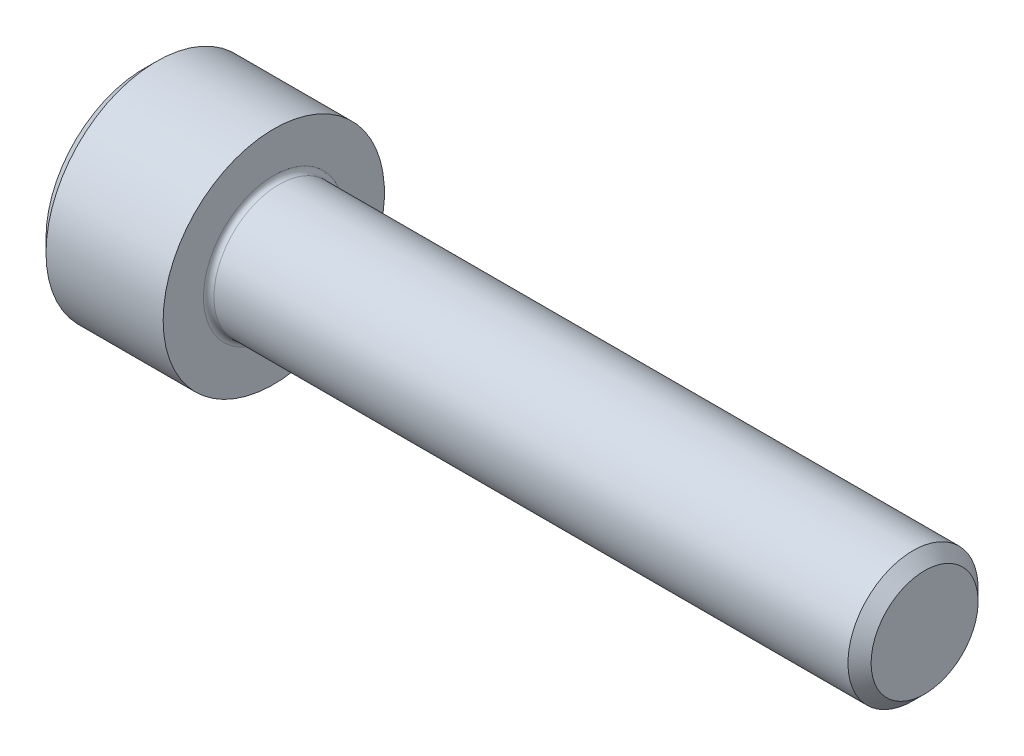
ISO-10303-21;
HEADER;
FILE_DESCRIPTION(('STEP AP214'),'2;1');
FILE_NAME('part.step','',(''),(''),'','','');
FILE_SCHEMA(('AUTOMOTIVE_DESIGN { 1 0 10303 214 1 1 1 1 }'));
ENDSEC;
DATA;
#1=APPLICATION_CONTEXT('core data for automotive mechanical design processes');
#2=APPLICATION_PROTOCOL_DEFINITION('international standard','automotive_design',2000,#1);
#3=PRODUCT_CONTEXT('',#1,'mechanical');
#4=PRODUCT('Part','Part','',(#3));
#5=PRODUCT_RELATED_PRODUCT_CATEGORY('part','',(#4));
#6=PRODUCT_DEFINITION_FORMATION('','',#4);
#7=PRODUCT_DEFINITION_CONTEXT('part definition',#1,'design');
#8=PRODUCT_DEFINITION('design','',#6,#7);
#9=PRODUCT_DEFINITION_SHAPE('','',#8);
#10=(LENGTH_UNIT() NAMED_UNIT(*) SI_UNIT(.MILLI.,.METRE.));
#11=(NAMED_UNIT(*) PLANE_ANGLE_UNIT() SI_UNIT($,.RADIAN.));
#12=(NAMED_UNIT(*) SI_UNIT($,.STERADIAN.) SOLID_ANGLE_UNIT());
#13=UNCERTAINTY_MEASURE_WITH_UNIT(LENGTH_MEASURE(1.E-05),#10,'distance_accuracy_value','');
#14=(GEOMETRIC_REPRESENTATION_CONTEXT(3) GLOBAL_UNCERTAINTY_ASSIGNED_CONTEXT((#13)) GLOBAL_UNIT_ASSIGNED_CONTEXT((#10,
#11,#12)) REPRESENTATION_CONTEXT('',''));
#15=CARTESIAN_POINT('',(0.,0.,0.));
#16=DIRECTION('',(0.,0.,1.));
#17=DIRECTION('',(1.,0.,0.));
#18=AXIS2_PLACEMENT_3D('',#15,#16,#17);
#19=CARTESIAN_POINT('',(0.,0.,0.));
#20=DIRECTION('',(-1.,0.,0.));
#21=DIRECTION('',(0.,0.,1.));
#22=AXIS2_PLACEMENT_3D('',#19,#20,#21);
#23=PLANE('',#22);
#24=DIRECTION('',(0.,-0.499999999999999,0.866025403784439));
#25=VECTOR('',#24,1.);
#26=CARTESIAN_POINT('',(0.,2.35789849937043,0.));
#27=LINE('',#26,#25);
#28=CARTESIAN_POINT('',(0.,2.35789849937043,0.));
#29=VERTEX_POINT('',#28);
#30=CARTESIAN_POINT('',(0.,1.17894924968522,2.042));
#31=VERTEX_POINT('',#30);
#32=EDGE_CURVE('E112',#29,#31,#27,.T.);
#33=ORIENTED_EDGE('',*,*,#32,.T.);
#34=DIRECTION('',(0.,1.,0.));
#35=VECTOR('',#34,1.);
#36=CARTESIAN_POINT('',(0.,-1.17894924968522,2.042));
#37=LINE('',#36,#35);
#38=CARTESIAN_POINT('',(0.,-1.17894924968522,2.042));
#39=VERTEX_POINT('',#38);
#40=EDGE_CURVE('E101',#39,#31,#37,.T.);
#41=ORIENTED_EDGE('',*,*,#40,.F.);
#42=DIRECTION('',(0.,-0.500000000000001,-0.866025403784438));
#43=VECTOR('',#42,1.);
#44=CARTESIAN_POINT('',(0.,-1.17894924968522,2.042));
#45=LINE('',#44,#43);
#46=CARTESIAN_POINT('',(0.,-2.35789849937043,0.));
#47=VERTEX_POINT('',#46);
#48=EDGE_CURVE('E111',#39,#47,#45,.T.);
#49=ORIENTED_EDGE('',*,*,#48,.T.);
#50=DIRECTION('',(0.,0.499999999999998,-0.86602540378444));
#51=VECTOR('',#50,1.);
#52=CARTESIAN_POINT('',(0.,-2.35789849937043,0.));
#53=LINE('',#52,#51);
#54=CARTESIAN_POINT('',(0.,-1.17894924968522,-2.042));
#55=VERTEX_POINT('',#54);
#56=EDGE_CURVE('E130',#47,#55,#53,.T.);
#57=ORIENTED_EDGE('',*,*,#56,.T.);
#58=DIRECTION('',(0.,-1.,0.));
#59=VECTOR('',#58,1.);
#60=CARTESIAN_POINT('',(0.,1.17894924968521,-2.042));
#61=LINE('',#60,#59);
#62=CARTESIAN_POINT('',(0.,1.17894924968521,-2.042));
#63=VERTEX_POINT('',#62);
#64=EDGE_CURVE('E133',#63,#55,#61,.T.);
#65=ORIENTED_EDGE('',*,*,#64,.F.);
#66=DIRECTION('',(0.,-0.500000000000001,-0.866025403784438));
#67=VECTOR('',#66,1.);
#68=CARTESIAN_POINT('',(0.,2.35789849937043,0.));
#69=LINE('',#68,#67);
#70=EDGE_CURVE('E126',#29,#63,#69,.T.);
#71=ORIENTED_EDGE('',*,*,#70,.F.);
#72=EDGE_LOOP('',(#33,#41,#49,#57,#65,#71));
#73=FACE_BOUND('',#72,.T.);
#74=CARTESIAN_POINT('',(0.,0.,0.));
#75=DIRECTION('',(-1.,0.,0.));
#76=DIRECTION('',(0.,0.,1.));
#77=AXIS2_PLACEMENT_3D('',#74,#75,#76);
#78=CIRCLE('',#77,3.75);
#79=CARTESIAN_POINT('',(0.,0.,3.75));
#80=VERTEX_POINT('',#79);
#81=EDGE_CURVE('E184',#80,#80,#78,.T.);
#82=ORIENTED_EDGE('',*,*,#81,.T.);
#83=EDGE_LOOP('',(#82));
#84=FACE_BOUND('',#83,.T.);
#85=ADVANCED_FACE('F30',(#73,#84),#23,.T.);
#86=CARTESIAN_POINT('',(0.,0.,0.));
#87=DIRECTION('',(1.,0.,0.));
#88=DIRECTION('',(0.,0.,-1.));
#89=AXIS2_PLACEMENT_3D('',#86,#87,#88);
#90=CONICAL_SURFACE('',#89,3.75,0.785398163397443);
#91=CARTESIAN_POINT('',(0.5,0.,0.));
#92=DIRECTION('',(-1.,0.,0.));
#93=DIRECTION('',(0.,0.,1.));
#94=AXIS2_PLACEMENT_3D('',#91,#92,#93);
#95=CIRCLE('',#94,4.25);
#96=CARTESIAN_POINT('',(0.5,0.,4.25));
#97=VERTEX_POINT('',#96);
#98=EDGE_CURVE('E181',#97,#97,#95,.T.);
#99=ORIENTED_EDGE('',*,*,#98,.T.);
#100=EDGE_LOOP('',(#99));
#101=FACE_BOUND('',#100,.T.);
#102=ORIENTED_EDGE('',*,*,#81,.F.);
#103=EDGE_LOOP('',(#102));
#104=FACE_BOUND('',#103,.T.);
#105=ADVANCED_FACE('F208',(#101,#104),#90,.T.);
#106=CARTESIAN_POINT('',(-31.75,0.,0.));
#107=DIRECTION('',(-1.,0.,0.));
#108=DIRECTION('',(0.,0.,1.));
#109=AXIS2_PLACEMENT_3D('',#106,#107,#108);
#110=CYLINDRICAL_SURFACE('',#109,4.25);
#111=CARTESIAN_POINT('',(5.,0.,0.));
#112=DIRECTION('',(-1.,0.,0.));
#113=DIRECTION('',(0.,0.,1.));
#114=AXIS2_PLACEMENT_3D('',#111,#112,#113);
#115=CIRCLE('',#114,4.25);
#116=CARTESIAN_POINT('',(5.,0.,4.25));
#117=VERTEX_POINT('',#116);
#118=EDGE_CURVE('E178',#117,#117,#115,.T.);
#119=ORIENTED_EDGE('',*,*,#118,.T.);
#120=EDGE_LOOP('',(#119));
#121=FACE_BOUND('',#120,.T.);
#122=ORIENTED_EDGE('',*,*,#98,.F.);
#123=EDGE_LOOP('',(#122));
#124=FACE_BOUND('',#123,.T.);
#125=ADVANCED_FACE('F212',(#121,#124),#110,.T.);
#126=CARTESIAN_POINT('',(5.,4.25,0.));
#127=DIRECTION('',(1.,0.,0.));
#128=DIRECTION('',(0.,0.,-1.));
#129=AXIS2_PLACEMENT_3D('',#126,#127,#128);
#130=PLANE('',#129);
#131=CARTESIAN_POINT('',(5.,0.,0.));
#132=DIRECTION('',(1.,0.,0.));
#133=DIRECTION('',(0.,0.,-1.));
#134=AXIS2_PLACEMENT_3D('',#131,#132,#133);
#135=CIRCLE('',#134,2.7);
#136=CARTESIAN_POINT('',(5.,0.,-2.7));
#137=VERTEX_POINT('',#136);
#138=EDGE_CURVE('E37',#137,#137,#135,.F.);
#139=ORIENTED_EDGE('',*,*,#138,.T.);
#140=EDGE_LOOP('',(#139));
#141=FACE_BOUND('',#140,.T.);
#142=ORIENTED_EDGE('',*,*,#118,.F.);
#143=EDGE_LOOP('',(#142));
#144=FACE_BOUND('',#143,.T.);
#145=ADVANCED_FACE('F189',(#141,#144),#130,.T.);
#146=CARTESIAN_POINT('',(-31.75,0.,0.));
#147=DIRECTION('',(-1.,0.,0.));
#148=DIRECTION('',(0.,0.,1.));
#149=AXIS2_PLACEMENT_3D('',#146,#147,#148);
#150=CYLINDRICAL_SURFACE('',#149,2.5);
#151=CARTESIAN_POINT('',(5.2,0.,0.));
#152=DIRECTION('',(1.,0.,0.));
#153=DIRECTION('',(0.,0.,-1.));
#154=AXIS2_PLACEMENT_3D('',#151,#152,#153);
#155=CIRCLE('',#154,2.5);
#156=CARTESIAN_POINT('',(5.2,0.,-2.5));
#157=VERTEX_POINT('',#156);
#158=EDGE_CURVE('E11',#157,#157,#155,.T.);
#159=ORIENTED_EDGE('',*,*,#158,.T.);
#160=EDGE_LOOP('',(#159));
#161=FACE_BOUND('',#160,.T.);
#162=CARTESIAN_POINT('',(29.555,0.,0.));
#163=DIRECTION('',(-1.,0.,0.));
#164=DIRECTION('',(0.,0.,1.));
#165=AXIS2_PLACEMENT_3D('',#162,#163,#164);
#166=CIRCLE('',#165,2.5);
#167=CARTESIAN_POINT('',(29.555,0.,2.5));
#168=VERTEX_POINT('',#167);
#169=EDGE_CURVE('E175',#168,#168,#166,.T.);
#170=ORIENTED_EDGE('',*,*,#169,.T.);
#171=EDGE_LOOP('',(#170));
#172=FACE_BOUND('',#171,.T.);
#173=ADVANCED_FACE('F223',(#161,#172),#150,.T.);
#174=CARTESIAN_POINT('',(30.,0.,0.));
#175=DIRECTION('',(-1.,0.,0.));
#176=DIRECTION('',(0.,0.,1.));
#177=AXIS2_PLACEMENT_3D('',#174,#175,#176);
#178=CONICAL_SURFACE('',#177,2.055,0.785398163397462);
#179=ORIENTED_EDGE('',*,*,#169,.F.);
#180=EDGE_LOOP('',(#179));
#181=FACE_BOUND('',#180,.T.);
#182=CARTESIAN_POINT('',(30.,0.,0.));
#183=DIRECTION('',(-1.,0.,0.));
#184=DIRECTION('',(0.,0.,1.));
#185=AXIS2_PLACEMENT_3D('',#182,#183,#184);
#186=CIRCLE('',#185,2.055);
#187=CARTESIAN_POINT('',(30.,0.,2.055));
#188=VERTEX_POINT('',#187);
#189=EDGE_CURVE('E171',#188,#188,#186,.T.);
#190=ORIENTED_EDGE('',*,*,#189,.T.);
#191=EDGE_LOOP('',(#190));
#192=FACE_BOUND('',#191,.T.);
#193=ADVANCED_FACE('F202',(#181,#192),#178,.T.);
#194=CARTESIAN_POINT('',(30.,2.055,0.));
#195=DIRECTION('',(1.,0.,0.));
#196=DIRECTION('',(0.,0.,-1.));
#197=AXIS2_PLACEMENT_3D('',#194,#195,#196);
#198=PLANE('',#197);
#199=ORIENTED_EDGE('',*,*,#189,.F.);
#200=EDGE_LOOP('',(#199));
#201=FACE_BOUND('',#200,.T.);
#202=ADVANCED_FACE('F194',(#201),#198,.T.);
#203=CARTESIAN_POINT('',(5.2,0.,0.));
#204=DIRECTION('',(1.,0.,0.));
#205=DIRECTION('',(0.,0.,-1.));
#206=AXIS2_PLACEMENT_3D('',#203,#204,#205);
#207=TOROIDAL_SURFACE('',#206,2.7,0.2);
#208=ORIENTED_EDGE('',*,*,#158,.F.);
#209=EDGE_LOOP('',(#208));
#210=FACE_BOUND('',#209,.T.);
#211=ORIENTED_EDGE('',*,*,#138,.F.);
#212=EDGE_LOOP('',(#211));
#213=FACE_BOUND('',#212,.T.);
#214=ADVANCED_FACE('F192',(#210,#213),#207,.F.);
#215=CARTESIAN_POINT('',(2.5,2.35789849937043,0.));
#216=DIRECTION('',(0.,-0.866025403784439,-0.499999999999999));
#217=DIRECTION('',(0.,0.499999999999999,-0.866025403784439));
#218=AXIS2_PLACEMENT_3D('',#215,#216,#217);
#219=PLANE('',#218);
#220=ORIENTED_EDGE('',*,*,#32,.F.);
#221=DIRECTION('',(-1.,0.,0.));
#222=VECTOR('',#221,1.);
#223=CARTESIAN_POINT('',(2.5,2.35789849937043,0.));
#224=LINE('',#223,#222);
#225=CARTESIAN_POINT('',(2.5,2.35789849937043,0.));
#226=VERTEX_POINT('',#225);
#227=EDGE_CURVE('E156',#226,#29,#224,.T.);
#228=ORIENTED_EDGE('',*,*,#227,.F.);
#229=DIRECTION('',(0.,-0.499999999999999,0.866025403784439));
#230=VECTOR('',#229,1.);
#231=CARTESIAN_POINT('',(2.5,2.35789849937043,0.));
#232=LINE('',#231,#230);
#233=CARTESIAN_POINT('',(2.5,1.76842387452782,1.021));
#234=VERTEX_POINT('',#233);
#235=EDGE_CURVE('E136',#226,#234,#232,.T.);
#236=ORIENTED_EDGE('',*,*,#235,.T.);
#237=CARTESIAN_POINT('',(2.5,1.17894924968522,2.042));
#238=VERTEX_POINT('',#237);
#239=EDGE_CURVE('E120',#234,#238,#232,.T.);
#240=ORIENTED_EDGE('',*,*,#239,.T.);
#241=DIRECTION('',(-1.,0.,0.));
#242=VECTOR('',#241,1.);
#243=CARTESIAN_POINT('',(2.5,1.17894924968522,2.042));
#244=LINE('',#243,#242);
#245=EDGE_CURVE('E105',#238,#31,#244,.T.);
#246=ORIENTED_EDGE('',*,*,#245,.T.);
#247=EDGE_LOOP('',(#220,#228,#236,#240,#246));
#248=FACE_BOUND('',#247,.T.);
#249=ADVANCED_FACE('F116',(#248),#219,.T.);
#250=CARTESIAN_POINT('',(2.5,-1.17894924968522,2.042));
#251=DIRECTION('',(0.,0.,1.));
#252=DIRECTION('',(0.,-1.,0.));
#253=AXIS2_PLACEMENT_3D('',#250,#251,#252);
#254=PLANE('',#253);
#255=ORIENTED_EDGE('',*,*,#40,.T.);
#256=ORIENTED_EDGE('',*,*,#245,.F.);
#257=DIRECTION('',(0.,1.,0.));
#258=VECTOR('',#257,1.);
#259=CARTESIAN_POINT('',(2.5,-1.17894924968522,2.042));
#260=LINE('',#259,#258);
#261=CARTESIAN_POINT('',(2.5,0.,2.042));
#262=VERTEX_POINT('',#261);
#263=EDGE_CURVE('E138',#262,#238,#260,.T.);
#264=ORIENTED_EDGE('',*,*,#263,.F.);
#265=CARTESIAN_POINT('',(2.5,-1.17894924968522,2.042));
#266=VERTEX_POINT('',#265);
#267=EDGE_CURVE('E139',#266,#262,#260,.T.);
#268=ORIENTED_EDGE('',*,*,#267,.F.);
#269=DIRECTION('',(-1.,0.,0.));
#270=VECTOR('',#269,1.);
#271=CARTESIAN_POINT('',(2.5,-1.17894924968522,2.042));
#272=LINE('',#271,#270);
#273=EDGE_CURVE('E107',#266,#39,#272,.T.);
#274=ORIENTED_EDGE('',*,*,#273,.T.);
#275=EDGE_LOOP('',(#255,#256,#264,#268,#274));
#276=FACE_BOUND('',#275,.T.);
#277=ADVANCED_FACE('F103',(#276),#254,.F.);
#278=CARTESIAN_POINT('',(2.5,-1.17894924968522,2.042));
#279=DIRECTION('',(0.,0.866025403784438,-0.500000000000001));
#280=DIRECTION('',(0.,0.500000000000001,0.866025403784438));
#281=AXIS2_PLACEMENT_3D('',#278,#279,#280);
#282=PLANE('',#281);
#283=ORIENTED_EDGE('',*,*,#48,.F.);
#284=ORIENTED_EDGE('',*,*,#273,.F.);
#285=DIRECTION('',(0.,-0.500000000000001,-0.866025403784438));
#286=VECTOR('',#285,1.);
#287=CARTESIAN_POINT('',(2.5,-1.17894924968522,2.042));
#288=LINE('',#287,#286);
#289=CARTESIAN_POINT('',(2.5,-1.76842387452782,1.021));
#290=VERTEX_POINT('',#289);
#291=EDGE_CURVE('E143',#266,#290,#288,.T.);
#292=ORIENTED_EDGE('',*,*,#291,.T.);
#293=CARTESIAN_POINT('',(2.5,-2.35789849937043,0.));
#294=VERTEX_POINT('',#293);
#295=EDGE_CURVE('E142',#290,#294,#288,.T.);
#296=ORIENTED_EDGE('',*,*,#295,.T.);
#297=DIRECTION('',(-1.,0.,0.));
#298=VECTOR('',#297,1.);
#299=CARTESIAN_POINT('',(2.5,-2.35789849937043,0.));
#300=LINE('',#299,#298);
#301=EDGE_CURVE('E164',#294,#47,#300,.T.);
#302=ORIENTED_EDGE('',*,*,#301,.T.);
#303=EDGE_LOOP('',(#283,#284,#292,#296,#302));
#304=FACE_BOUND('',#303,.T.);
#305=ADVANCED_FACE('F277',(#304),#282,.T.);
#306=CARTESIAN_POINT('',(2.5,-2.35789849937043,0.));
#307=DIRECTION('',(0.,0.86602540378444,0.499999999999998));
#308=DIRECTION('',(0.,-0.499999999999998,0.86602540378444));
#309=AXIS2_PLACEMENT_3D('',#306,#307,#308);
#310=PLANE('',#309);
#311=ORIENTED_EDGE('',*,*,#56,.F.);
#312=ORIENTED_EDGE('',*,*,#301,.F.);
#313=DIRECTION('',(0.,0.499999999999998,-0.86602540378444));
#314=VECTOR('',#313,1.);
#315=CARTESIAN_POINT('',(2.5,-2.35789849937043,0.));
#316=LINE('',#315,#314);
#317=CARTESIAN_POINT('',(2.5,-1.76842387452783,-1.021));
#318=VERTEX_POINT('',#317);
#319=EDGE_CURVE('E147',#294,#318,#316,.T.);
#320=ORIENTED_EDGE('',*,*,#319,.T.);
#321=CARTESIAN_POINT('',(2.5,-1.17894924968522,-2.042));
#322=VERTEX_POINT('',#321);
#323=EDGE_CURVE('E146',#318,#322,#316,.T.);
#324=ORIENTED_EDGE('',*,*,#323,.T.);
#325=DIRECTION('',(-1.,0.,0.));
#326=VECTOR('',#325,1.);
#327=CARTESIAN_POINT('',(2.5,-1.17894924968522,-2.042));
#328=LINE('',#327,#326);
#329=EDGE_CURVE('E161',#322,#55,#328,.T.);
#330=ORIENTED_EDGE('',*,*,#329,.T.);
#331=EDGE_LOOP('',(#311,#312,#320,#324,#330));
#332=FACE_BOUND('',#331,.T.);
#333=ADVANCED_FACE('F286',(#332),#310,.T.);
#334=CARTESIAN_POINT('',(2.5,1.17894924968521,-2.042));
#335=DIRECTION('',(0.,0.,-1.));
#336=DIRECTION('',(0.,1.,0.));
#337=AXIS2_PLACEMENT_3D('',#334,#335,#336);
#338=PLANE('',#337);
#339=ORIENTED_EDGE('',*,*,#64,.T.);
#340=ORIENTED_EDGE('',*,*,#329,.F.);
#341=DIRECTION('',(0.,-1.,0.));
#342=VECTOR('',#341,1.);
#343=CARTESIAN_POINT('',(2.5,1.17894924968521,-2.042));
#344=LINE('',#343,#342);
#345=CARTESIAN_POINT('',(2.5,0.,-2.042));
#346=VERTEX_POINT('',#345);
#347=EDGE_CURVE('E150',#346,#322,#344,.T.);
#348=ORIENTED_EDGE('',*,*,#347,.F.);
#349=CARTESIAN_POINT('',(2.5,1.17894924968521,-2.042));
#350=VERTEX_POINT('',#349);
#351=EDGE_CURVE('E44',#350,#346,#344,.T.);
#352=ORIENTED_EDGE('',*,*,#351,.F.);
#353=DIRECTION('',(-1.,0.,0.));
#354=VECTOR('',#353,1.);
#355=CARTESIAN_POINT('',(2.5,1.17894924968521,-2.042));
#356=LINE('',#355,#354);
#357=EDGE_CURVE('E158',#350,#63,#356,.T.);
#358=ORIENTED_EDGE('',*,*,#357,.T.);
#359=EDGE_LOOP('',(#339,#340,#348,#352,#358));
#360=FACE_BOUND('',#359,.T.);
#361=ADVANCED_FACE('F296',(#360),#338,.F.);
#362=CARTESIAN_POINT('',(2.5,2.35789849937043,0.));
#363=DIRECTION('',(0.,0.866025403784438,-0.500000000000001));
#364=DIRECTION('',(0.,0.500000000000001,0.866025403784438));
#365=AXIS2_PLACEMENT_3D('',#362,#363,#364);
#366=PLANE('',#365);
#367=ORIENTED_EDGE('',*,*,#70,.T.);
#368=ORIENTED_EDGE('',*,*,#357,.F.);
#369=DIRECTION('',(0.,-0.500000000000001,-0.866025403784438));
#370=VECTOR('',#369,1.);
#371=CARTESIAN_POINT('',(2.5,2.35789849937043,0.));
#372=LINE('',#371,#370);
#373=CARTESIAN_POINT('',(2.5,1.76842387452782,-1.021));
#374=VERTEX_POINT('',#373);
#375=EDGE_CURVE('E152',#374,#350,#372,.T.);
#376=ORIENTED_EDGE('',*,*,#375,.F.);
#377=EDGE_CURVE('E153',#226,#374,#372,.T.);
#378=ORIENTED_EDGE('',*,*,#377,.F.);
#379=ORIENTED_EDGE('',*,*,#227,.T.);
#380=EDGE_LOOP('',(#367,#368,#376,#378,#379));
#381=FACE_BOUND('',#380,.T.);
#382=ADVANCED_FACE('F306',(#381),#366,.F.);
#383=CARTESIAN_POINT('',(2.5,3.53684774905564,-2.04200000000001));
#384=DIRECTION('',(1.,0.,0.));
#385=DIRECTION('',(0.,0.,-1.));
#386=AXIS2_PLACEMENT_3D('',#383,#384,#385);
#387=PLANE('',#386);
#388=ORIENTED_EDGE('',*,*,#347,.T.);
#389=ORIENTED_EDGE('',*,*,#323,.F.);
#390=CARTESIAN_POINT('',(2.5,0.,0.));
#391=DIRECTION('',(-1.,0.,0.));
#392=DIRECTION('',(0.,0.,1.));
#393=AXIS2_PLACEMENT_3D('',#390,#391,#392);
#394=CIRCLE('',#393,2.042);
#395=EDGE_CURVE('E392',#346,#318,#394,.T.);
#396=ORIENTED_EDGE('',*,*,#395,.F.);
#397=EDGE_LOOP('',(#388,#389,#396));
#398=FACE_BOUND('',#397,.T.);
#399=ADVANCED_FACE('F316',(#398),#387,.F.);
#400=ORIENTED_EDGE('',*,*,#319,.F.);
#401=ORIENTED_EDGE('',*,*,#295,.F.);
#402=EDGE_CURVE('E390',#318,#290,#394,.T.);
#403=ORIENTED_EDGE('',*,*,#402,.F.);
#404=EDGE_LOOP('',(#400,#401,#403));
#405=FACE_BOUND('',#404,.T.);
#406=ADVANCED_FACE('F326',(#405),#387,.F.);
#407=ORIENTED_EDGE('',*,*,#291,.F.);
#408=ORIENTED_EDGE('',*,*,#267,.T.);
#409=EDGE_CURVE('E121',#290,#262,#394,.T.);
#410=ORIENTED_EDGE('',*,*,#409,.F.);
#411=EDGE_LOOP('',(#407,#408,#410));
#412=FACE_BOUND('',#411,.T.);
#413=ADVANCED_FACE('F337',(#412),#387,.F.);
#414=ORIENTED_EDGE('',*,*,#263,.T.);
#415=ORIENTED_EDGE('',*,*,#239,.F.);
#416=EDGE_CURVE('E168',#262,#234,#394,.T.);
#417=ORIENTED_EDGE('',*,*,#416,.F.);
#418=EDGE_LOOP('',(#414,#415,#417));
#419=FACE_BOUND('',#418,.T.);
#420=ADVANCED_FACE('F346',(#419),#387,.F.);
#421=ORIENTED_EDGE('',*,*,#235,.F.);
#422=ORIENTED_EDGE('',*,*,#377,.T.);
#423=EDGE_CURVE('E172',#234,#374,#394,.T.);
#424=ORIENTED_EDGE('',*,*,#423,.F.);
#425=EDGE_LOOP('',(#421,#422,#424));
#426=FACE_BOUND('',#425,.T.);
#427=ADVANCED_FACE('F355',(#426),#387,.F.);
#428=ORIENTED_EDGE('',*,*,#375,.T.);
#429=ORIENTED_EDGE('',*,*,#351,.T.);
#430=EDGE_CURVE('E395',#374,#346,#394,.T.);
#431=ORIENTED_EDGE('',*,*,#430,.F.);
#432=EDGE_LOOP('',(#428,#429,#431));
#433=FACE_BOUND('',#432,.T.);
#434=ADVANCED_FACE('F329',(#433),#387,.F.);
#435=CARTESIAN_POINT('',(2.5,0.,0.));
#436=DIRECTION('',(-1.,0.,0.));
#437=DIRECTION('',(0.,0.,1.));
#438=AXIS2_PLACEMENT_3D('',#435,#436,#437);
#439=CONICAL_SURFACE('',#438,2.042,1.04719755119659);
#440=CARTESIAN_POINT('',(3.67894924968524,0.,0.));
#441=VERTEX_POINT('',#440);
#442=VERTEX_LOOP('',#441);
#443=FACE_BOUND('',#442,.T.);
#444=ORIENTED_EDGE('',*,*,#416,.T.);
#445=ORIENTED_EDGE('',*,*,#423,.T.);
#446=ORIENTED_EDGE('',*,*,#430,.T.);
#447=ORIENTED_EDGE('',*,*,#395,.T.);
#448=ORIENTED_EDGE('',*,*,#402,.T.);
#449=ORIENTED_EDGE('',*,*,#409,.T.);
#450=EDGE_LOOP('',(#444,#445,#446,#447,#448,#449));
#451=FACE_BOUND('',#450,.T.);
#452=ADVANCED_FACE('F372',(#443,#451),#439,.F.);
#453=CLOSED_SHELL('',(#85,#105,#125,#145,#173,#193,#202,#214,#249,#277,#305,#333,#361,#382,#399,
#406,#413,#420,#427,#434,#452));
#454=MANIFOLD_SOLID_BREP('B2',#453);
#455=ADVANCED_BREP_SHAPE_REPRESENTATION('',(#18,#454),#14);
#456=SHAPE_DEFINITION_REPRESENTATION(#9,#455);
ENDSEC;
END-ISO-10303-21;
